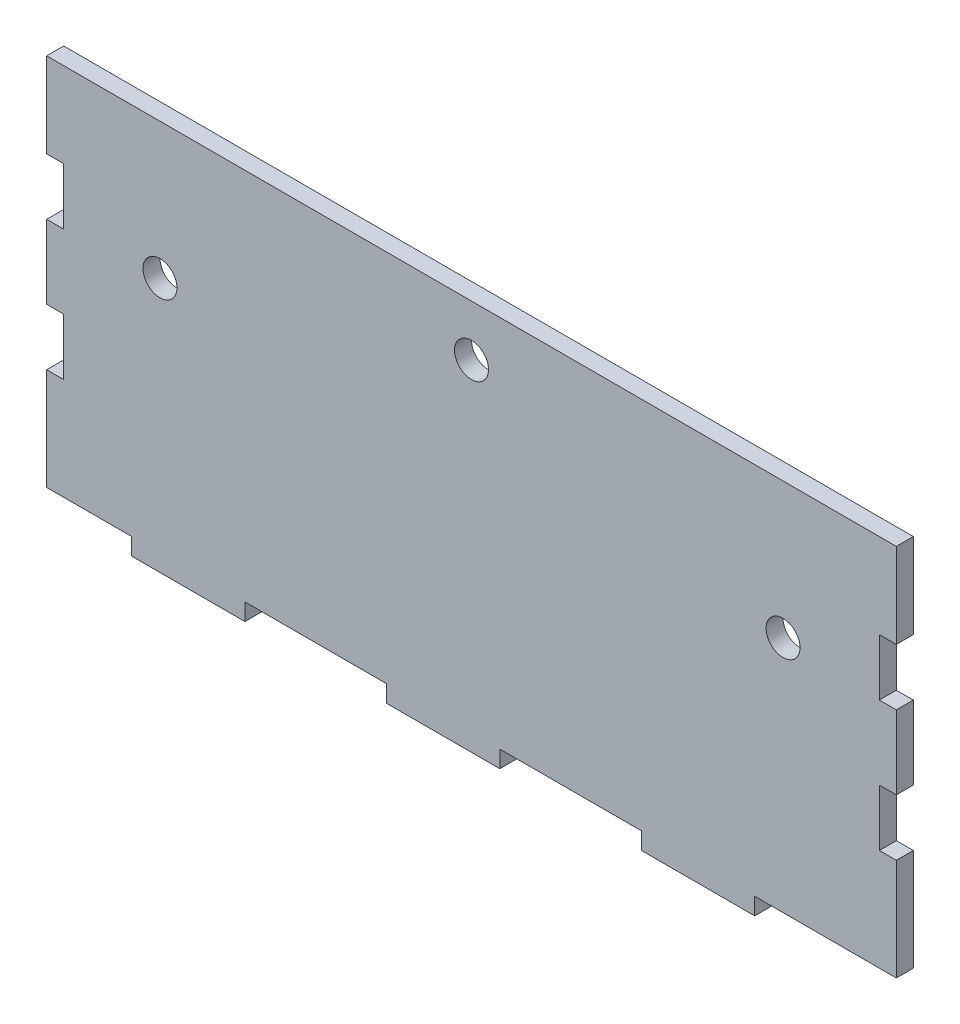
from build123d import *

# Parameters (mm, degrees)
CROQUIS1_W              = 150
CROQUIS1_H              = 75
SALIENTE_EXTRUIR1_DEPTH = 3
CROQUIS2_R              = 3
CROQUIS2_W              = 150
CROQUIS2_H              = 6
CROQUIS2_W_2            = 25
CROQUIS2_H_2            = 3
CROQUIS2_W_3            = 15
CROQUIS2_W_4            = 3
CROQUIS2_H_3            = 10
CORTAR_EXTRUIR1_DEPTH   = 6


with BuildPart() as part:
    # Croquis1 → Saliente-Extruir1 (new body)
    with BuildSketch(Plane.XY):
        with Locations((75, 37.5)):
            Rectangle(CROQUIS1_W, CROQUIS1_H)
    extrude(amount=SALIENTE_EXTRUIR1_DEPTH)

    # Croquis2 → Cortar-Extruir1 (cut)
    with BuildSketch(Plane.XY.offset(3)):
        with Locations((75, 60)):
            Circle(CROQUIS2_R)
        with Locations((130, 45)):
            Circle(CROQUIS2_R)
        with Locations(Location((20, 45, 0), (0, 0, 180))):
            Circle(CROQUIS2_R)
        with Locations((75, 72)):
            Rectangle(CROQUIS2_W, CROQUIS2_H)
        with Locations((137.5, 1.5)):
            Rectangle(CROQUIS2_W_2, CROQUIS2_H_2)
        with Locations((92.5, 1.5)):
            Rectangle(CROQUIS2_W_2, CROQUIS2_H_2)
        with Locations((47.5, 1.5)):
            Rectangle(CROQUIS2_W_2, CROQUIS2_H_2)
        with Locations((7.5, 1.5)):
            Rectangle(CROQUIS2_W_3, CROQUIS2_H_2)
        with Locations((148.5, 49)):
            Rectangle(CROQUIS2_W_4, CROQUIS2_H_3)
        with Locations((1.5, 26)):
            Rectangle(CROQUIS2_W_4, CROQUIS2_H_3)
        with Locations((1.5, 49)):
            Rectangle(CROQUIS2_W_4, CROQUIS2_H_3)
        with Locations((148.5, 26)):
            Rectangle(CROQUIS2_W_4, CROQUIS2_H_3)
    extrude(amount=-CORTAR_EXTRUIR1_DEPTH, mode=Mode.SUBTRACT)


solid = part.part
